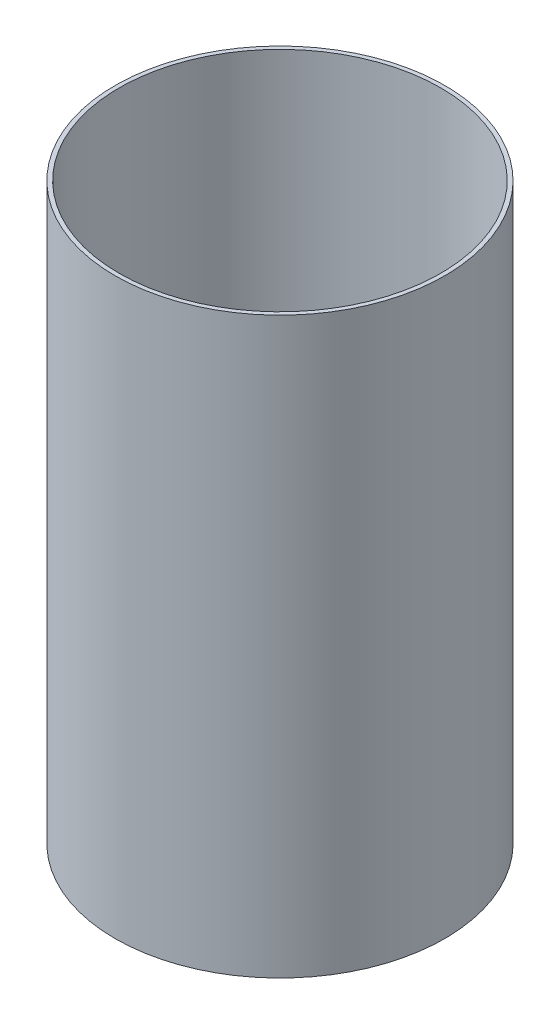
from build123d import *

# Parameters (mm, degrees)
SKETCH1_R           = 10.05
SKETCH1_R_2         = 9.8
BOSS_EXTRUDE1_DEPTH = 17.5


with BuildPart() as part:
    # Sketch1 → Boss-Extrude1 (new, symmetric)
    with BuildSketch(Plane(origin=(0, 0, 0), x_dir=(1, 0, 0), z_dir=(0, 1, 0))):
        with Locations(Location((0, 0, 0), (0, 0, 270))):
            Circle(SKETCH1_R)
        with Locations(Location((0, 0, 0), (0, 0, 270))):
            Circle(SKETCH1_R_2, mode=Mode.SUBTRACT)
    extrude(amount=BOSS_EXTRUDE1_DEPTH, both=True)


solid = part.part
